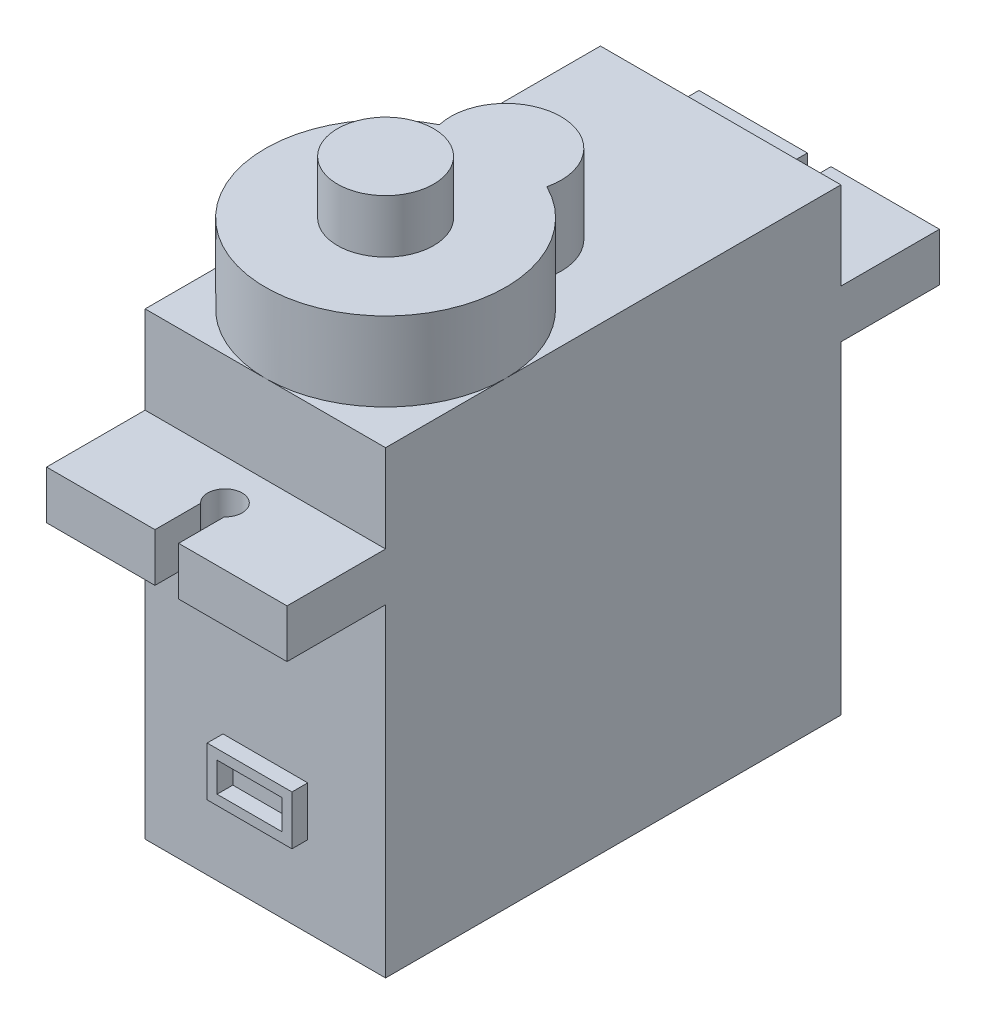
ISO-10303-21;
HEADER;
FILE_DESCRIPTION(('STEP AP214'),'2;1');
FILE_NAME('part.step','',(''),(''),'','','');
FILE_SCHEMA(('AUTOMOTIVE_DESIGN { 1 0 10303 214 1 1 1 1 }'));
ENDSEC;
DATA;
#1=APPLICATION_CONTEXT('core data for automotive mechanical design processes');
#2=APPLICATION_PROTOCOL_DEFINITION('international standard','automotive_design',2000,#1);
#3=PRODUCT_CONTEXT('',#1,'mechanical');
#4=PRODUCT('Part','Part','',(#3));
#5=PRODUCT_RELATED_PRODUCT_CATEGORY('part','',(#4));
#6=PRODUCT_DEFINITION_FORMATION('','',#4);
#7=PRODUCT_DEFINITION_CONTEXT('part definition',#1,'design');
#8=PRODUCT_DEFINITION('design','',#6,#7);
#9=PRODUCT_DEFINITION_SHAPE('','',#8);
#10=(LENGTH_UNIT() NAMED_UNIT(*) SI_UNIT(.MILLI.,.METRE.));
#11=(NAMED_UNIT(*) PLANE_ANGLE_UNIT() SI_UNIT($,.RADIAN.));
#12=(NAMED_UNIT(*) SI_UNIT($,.STERADIAN.) SOLID_ANGLE_UNIT());
#13=UNCERTAINTY_MEASURE_WITH_UNIT(LENGTH_MEASURE(1.E-05),#10,'distance_accuracy_value','');
#14=(GEOMETRIC_REPRESENTATION_CONTEXT(3) GLOBAL_UNCERTAINTY_ASSIGNED_CONTEXT((#13)) GLOBAL_UNIT_ASSIGNED_CONTEXT((#10,
#11,#12)) REPRESENTATION_CONTEXT('',''));
#15=CARTESIAN_POINT('',(0.,0.,0.));
#16=DIRECTION('',(0.,0.,1.));
#17=DIRECTION('',(1.,0.,0.));
#18=AXIS2_PLACEMENT_3D('',#15,#16,#17);
#19=CARTESIAN_POINT('',(12.2,18.85,-28.1));
#20=DIRECTION('',(0.,0.,1.));
#21=DIRECTION('',(1.,0.,0.));
#22=AXIS2_PLACEMENT_3D('',#19,#20,#21);
#23=PLANE('',#22);
#24=DIRECTION('',(-1.,0.,0.));
#25=VECTOR('',#24,1.);
#26=CARTESIAN_POINT('',(12.2,18.85,-28.1));
#27=LINE('',#26,#25);
#28=CARTESIAN_POINT('',(5.5,18.85,-28.1));
#29=VERTEX_POINT('',#28);
#30=CARTESIAN_POINT('',(0.,18.85,-28.1));
#31=VERTEX_POINT('',#30);
#32=EDGE_CURVE('E270',#29,#31,#27,.T.);
#33=ORIENTED_EDGE('',*,*,#32,.F.);
#34=DIRECTION('',(0.,1.,0.));
#35=VECTOR('',#34,1.);
#36=CARTESIAN_POINT('',(5.5,16.35,-28.1));
#37=LINE('',#36,#35);
#38=CARTESIAN_POINT('',(5.5,16.4,-28.1));
#39=VERTEX_POINT('',#38);
#40=EDGE_CURVE('E264',#39,#29,#37,.T.);
#41=ORIENTED_EDGE('',*,*,#40,.F.);
#42=DIRECTION('',(-1.,0.,0.));
#43=VECTOR('',#42,1.);
#44=CARTESIAN_POINT('',(12.2,16.4,-28.1));
#45=LINE('',#44,#43);
#46=CARTESIAN_POINT('',(0.,16.4,-28.1));
#47=VERTEX_POINT('',#46);
#48=EDGE_CURVE('E269',#39,#47,#45,.T.);
#49=ORIENTED_EDGE('',*,*,#48,.T.);
#50=DIRECTION('',(0.,1.,0.));
#51=VECTOR('',#50,1.);
#52=CARTESIAN_POINT('',(0.,18.85,-28.1));
#53=LINE('',#52,#51);
#54=EDGE_CURVE('E468',#47,#31,#53,.T.);
#55=ORIENTED_EDGE('',*,*,#54,.T.);
#56=EDGE_LOOP('',(#33,#41,#49,#55));
#57=FACE_BOUND('',#56,.T.);
#58=ADVANCED_FACE('F39',(#57),#23,.F.);
#59=CARTESIAN_POINT('',(12.2,18.85,5.));
#60=DIRECTION('',(0.,0.,-1.));
#61=DIRECTION('',(0.,1.,0.));
#62=AXIS2_PLACEMENT_3D('',#59,#60,#61);
#63=PLANE('',#62);
#64=DIRECTION('',(-1.,0.,0.));
#65=VECTOR('',#64,1.);
#66=CARTESIAN_POINT('',(12.2,18.85,5.));
#67=LINE('',#66,#65);
#68=CARTESIAN_POINT('',(12.2,18.85,5.));
#69=VERTEX_POINT('',#68);
#70=CARTESIAN_POINT('',(6.7,18.85,5.));
#71=VERTEX_POINT('',#70);
#72=EDGE_CURVE('E294',#69,#71,#67,.T.);
#73=ORIENTED_EDGE('',*,*,#72,.T.);
#74=DIRECTION('',(0.,1.,0.));
#75=VECTOR('',#74,1.);
#76=CARTESIAN_POINT('',(6.7,16.35,5.));
#77=LINE('',#76,#75);
#78=CARTESIAN_POINT('',(6.7,16.4,5.));
#79=VERTEX_POINT('',#78);
#80=EDGE_CURVE('E326',#79,#71,#77,.T.);
#81=ORIENTED_EDGE('',*,*,#80,.F.);
#82=DIRECTION('',(-1.,0.,0.));
#83=VECTOR('',#82,1.);
#84=CARTESIAN_POINT('',(12.2,16.4,4.99999999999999));
#85=LINE('',#84,#83);
#86=CARTESIAN_POINT('',(12.2,16.4,4.99999999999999));
#87=VERTEX_POINT('',#86);
#88=EDGE_CURVE('E290',#87,#79,#85,.T.);
#89=ORIENTED_EDGE('',*,*,#88,.F.);
#90=DIRECTION('',(0.,-1.,0.));
#91=VECTOR('',#90,1.);
#92=CARTESIAN_POINT('',(12.2,18.85,5.));
#93=LINE('',#92,#91);
#94=EDGE_CURVE('E428',#69,#87,#93,.T.);
#95=ORIENTED_EDGE('',*,*,#94,.F.);
#96=EDGE_LOOP('',(#73,#81,#89,#95));
#97=FACE_BOUND('',#96,.T.);
#98=ADVANCED_FACE('F561',(#97),#63,.F.);
#99=CARTESIAN_POINT('',(12.2,16.4,0.));
#100=DIRECTION('',(0.,0.,-1.));
#101=DIRECTION('',(0.,1.,0.));
#102=AXIS2_PLACEMENT_3D('',#99,#100,#101);
#103=PLANE('',#102);
#104=DIRECTION('',(0.,-1.,0.));
#105=VECTOR('',#104,1.);
#106=CARTESIAN_POINT('',(0.,16.4,0.));
#107=LINE('',#106,#105);
#108=CARTESIAN_POINT('',(0.,16.4,0.));
#109=VERTEX_POINT('',#108);
#110=CARTESIAN_POINT('',(0.,0.,0.));
#111=VERTEX_POINT('',#110);
#112=EDGE_CURVE('E459',#109,#111,#107,.T.);
#113=ORIENTED_EDGE('',*,*,#112,.T.);
#114=DIRECTION('',(-1.,0.,0.));
#115=VECTOR('',#114,1.);
#116=CARTESIAN_POINT('',(12.2,0.,0.));
#117=LINE('',#116,#115);
#118=CARTESIAN_POINT('',(12.2,0.,0.));
#119=VERTEX_POINT('',#118);
#120=EDGE_CURVE('E283',#119,#111,#117,.T.);
#121=ORIENTED_EDGE('',*,*,#120,.F.);
#122=DIRECTION('',(0.,-1.,0.));
#123=VECTOR('',#122,1.);
#124=CARTESIAN_POINT('',(12.2,16.4,0.));
#125=LINE('',#124,#123);
#126=CARTESIAN_POINT('',(12.2,16.4,0.));
#127=VERTEX_POINT('',#126);
#128=EDGE_CURVE('E432',#127,#119,#125,.T.);
#129=ORIENTED_EDGE('',*,*,#128,.F.);
#130=DIRECTION('',(-1.,0.,0.));
#131=VECTOR('',#130,1.);
#132=CARTESIAN_POINT('',(12.2,16.4,0.));
#133=LINE('',#132,#131);
#134=EDGE_CURVE('E286',#127,#109,#133,.T.);
#135=ORIENTED_EDGE('',*,*,#134,.T.);
#136=EDGE_LOOP('',(#113,#121,#129,#135));
#137=FACE_BOUND('',#136,.T.);
#138=DIRECTION('',(0.,-1.,0.));
#139=VECTOR('',#138,1.);
#140=CARTESIAN_POINT('',(3.95,4.1,0.));
#141=LINE('',#140,#139);
#142=CARTESIAN_POINT('',(3.95,6.6,0.));
#143=VERTEX_POINT('',#142);
#144=CARTESIAN_POINT('',(3.95,4.1,0.));
#145=VERTEX_POINT('',#144);
#146=EDGE_CURVE('E363',#143,#145,#141,.T.);
#147=ORIENTED_EDGE('',*,*,#146,.F.);
#148=DIRECTION('',(-1.,0.,0.));
#149=VECTOR('',#148,1.);
#150=CARTESIAN_POINT('',(3.95,6.6,0.));
#151=LINE('',#150,#149);
#152=CARTESIAN_POINT('',(8.25,6.6,0.));
#153=VERTEX_POINT('',#152);
#154=EDGE_CURVE('E368',#153,#143,#151,.T.);
#155=ORIENTED_EDGE('',*,*,#154,.F.);
#156=DIRECTION('',(0.,1.,0.));
#157=VECTOR('',#156,1.);
#158=CARTESIAN_POINT('',(8.25,4.1,0.));
#159=LINE('',#158,#157);
#160=CARTESIAN_POINT('',(8.25,4.1,0.));
#161=VERTEX_POINT('',#160);
#162=EDGE_CURVE('E380',#161,#153,#159,.T.);
#163=ORIENTED_EDGE('',*,*,#162,.F.);
#164=DIRECTION('',(1.,0.,0.));
#165=VECTOR('',#164,1.);
#166=CARTESIAN_POINT('',(3.95,4.1,0.));
#167=LINE('',#166,#165);
#168=EDGE_CURVE('E377',#145,#161,#167,.T.);
#169=ORIENTED_EDGE('',*,*,#168,.F.);
#170=EDGE_LOOP('',(#147,#155,#163,#169));
#171=FACE_BOUND('',#170,.T.);
#172=ADVANCED_FACE('F553',(#137,#171),#103,.F.);
#173=CARTESIAN_POINT('',(6.1,27.3,-9.14999999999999));
#174=DIRECTION('',(0.,1.,0.));
#175=DIRECTION('',(0.,0.,1.));
#176=AXIS2_PLACEMENT_3D('',#173,#174,#175);
#177=PLANE('',#176);
#178=CARTESIAN_POINT('',(6.1,27.3,-12.2));
#179=DIRECTION('',(0.,1.,0.));
#180=DIRECTION('',(0.,0.,1.));
#181=AXIS2_PLACEMENT_3D('',#178,#179,#180);
#182=CIRCLE('',#181,2.8);
#183=CARTESIAN_POINT('',(8.82525883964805,27.3,-11.5573770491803));
#184=VERTEX_POINT('',#183);
#185=CARTESIAN_POINT('',(3.37474116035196,27.3,-11.5573770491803));
#186=VERTEX_POINT('',#185);
#187=EDGE_CURVE('E403',#184,#186,#182,.T.);
#188=ORIENTED_EDGE('',*,*,#187,.T.);
#189=CARTESIAN_POINT('',(6.1,27.3,-6.09999999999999));
#190=DIRECTION('',(0.,1.,0.));
#191=DIRECTION('',(0.,0.,1.));
#192=AXIS2_PLACEMENT_3D('',#189,#190,#191);
#193=CIRCLE('',#192,6.09999999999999);
#194=EDGE_CURVE('E406',#186,#184,#193,.T.);
#195=ORIENTED_EDGE('',*,*,#194,.T.);
#196=EDGE_LOOP('',(#188,#195));
#197=FACE_BOUND('',#196,.T.);
#198=CARTESIAN_POINT('',(6.1,27.3,-6.09999999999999));
#199=DIRECTION('',(0.,1.,0.));
#200=DIRECTION('',(0.,0.,1.));
#201=AXIS2_PLACEMENT_3D('',#198,#199,#200);
#202=CIRCLE('',#201,2.44);
#203=CARTESIAN_POINT('',(6.1,27.3,-8.53999999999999));
#204=VERTEX_POINT('',#203);
#205=EDGE_CURVE('E396',#204,#204,#202,.T.);
#206=ORIENTED_EDGE('',*,*,#205,.F.);
#207=EDGE_LOOP('',(#206));
#208=FACE_BOUND('',#207,.T.);
#209=ADVANCED_FACE('F568',(#197,#208),#177,.T.);
#210=CARTESIAN_POINT('',(12.2,23.3,0.));
#211=DIRECTION('',(0.,-1.,0.));
#212=DIRECTION('',(0.,0.,-1.));
#213=AXIS2_PLACEMENT_3D('',#210,#211,#212);
#214=PLANE('',#213);
#215=CARTESIAN_POINT('',(6.1,23.3,-12.2));
#216=DIRECTION('',(0.,1.,0.));
#217=DIRECTION('',(0.,0.,1.));
#218=AXIS2_PLACEMENT_3D('',#215,#216,#217);
#219=CIRCLE('',#218,2.8);
#220=CARTESIAN_POINT('',(8.82525883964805,23.3,-11.5573770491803));
#221=VERTEX_POINT('',#220);
#222=CARTESIAN_POINT('',(3.37474116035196,23.3,-11.5573770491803));
#223=VERTEX_POINT('',#222);
#224=EDGE_CURVE('E400',#221,#223,#219,.T.);
#225=ORIENTED_EDGE('',*,*,#224,.F.);
#226=CARTESIAN_POINT('',(6.1,23.3,-6.09999999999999));
#227=DIRECTION('',(0.,1.,0.));
#228=DIRECTION('',(0.,0.,1.));
#229=AXIS2_PLACEMENT_3D('',#226,#227,#228);
#230=CIRCLE('',#229,6.09999999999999);
#231=CARTESIAN_POINT('',(12.2,23.3,-6.09999999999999));
#232=VERTEX_POINT('',#231);
#233=EDGE_CURVE('E304',#232,#221,#230,.T.);
#234=ORIENTED_EDGE('',*,*,#233,.F.);
#235=DIRECTION('',(0.,0.,1.));
#236=VECTOR('',#235,1.);
#237=CARTESIAN_POINT('',(12.2,23.3,0.));
#238=LINE('',#237,#236);
#239=CARTESIAN_POINT('',(12.2,23.3,-23.1));
#240=VERTEX_POINT('',#239);
#241=EDGE_CURVE('E420',#240,#232,#238,.T.);
#242=ORIENTED_EDGE('',*,*,#241,.F.);
#243=DIRECTION('',(-1.,0.,0.));
#244=VECTOR('',#243,1.);
#245=CARTESIAN_POINT('',(12.2,23.3,-23.1));
#246=LINE('',#245,#244);
#247=CARTESIAN_POINT('',(0.,23.3,-23.1));
#248=VERTEX_POINT('',#247);
#249=EDGE_CURVE('E445',#240,#248,#246,.T.);
#250=ORIENTED_EDGE('',*,*,#249,.T.);
#251=DIRECTION('',(0.,0.,1.));
#252=VECTOR('',#251,1.);
#253=CARTESIAN_POINT('',(0.,23.3,0.));
#254=LINE('',#253,#252);
#255=CARTESIAN_POINT('',(0.,23.3,-6.09999999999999));
#256=VERTEX_POINT('',#255);
#257=EDGE_CURVE('E446',#248,#256,#254,.T.);
#258=ORIENTED_EDGE('',*,*,#257,.T.);
#259=EDGE_CURVE('E407',#223,#256,#230,.T.);
#260=ORIENTED_EDGE('',*,*,#259,.F.);
#261=EDGE_LOOP('',(#225,#234,#242,#250,#258,#260));
#262=FACE_BOUND('',#261,.T.);
#263=ADVANCED_FACE('F41',(#262),#214,.F.);
#264=CARTESIAN_POINT('',(6.1,23.3,0.));
#265=VERTEX_POINT('',#264);
#266=EDGE_CURVE('E306',#256,#265,#230,.T.);
#267=ORIENTED_EDGE('',*,*,#266,.F.);
#268=CARTESIAN_POINT('',(0.,23.3,0.));
#269=VERTEX_POINT('',#268);
#270=EDGE_CURVE('E419',#256,#269,#254,.T.);
#271=ORIENTED_EDGE('',*,*,#270,.T.);
#272=DIRECTION('',(-1.,0.,0.));
#273=VECTOR('',#272,1.);
#274=CARTESIAN_POINT('',(12.2,23.3,0.));
#275=LINE('',#274,#273);
#276=EDGE_CURVE('E300',#265,#269,#275,.T.);
#277=ORIENTED_EDGE('',*,*,#276,.F.);
#278=EDGE_LOOP('',(#267,#271,#277));
#279=FACE_BOUND('',#278,.T.);
#280=ADVANCED_FACE('F508',(#279),#214,.F.);
#281=EDGE_CURVE('E502',#265,#232,#230,.T.);
#282=ORIENTED_EDGE('',*,*,#281,.F.);
#283=CARTESIAN_POINT('',(12.2,23.3,0.));
#284=VERTEX_POINT('',#283);
#285=EDGE_CURVE('E301',#284,#265,#275,.T.);
#286=ORIENTED_EDGE('',*,*,#285,.F.);
#287=EDGE_CURVE('E424',#232,#284,#238,.T.);
#288=ORIENTED_EDGE('',*,*,#287,.F.);
#289=EDGE_LOOP('',(#282,#286,#288));
#290=FACE_BOUND('',#289,.T.);
#291=ADVANCED_FACE('F506',(#290),#214,.F.);
#292=CARTESIAN_POINT('',(12.2,23.3,0.));
#293=DIRECTION('',(0.,0.,-1.));
#294=DIRECTION('',(0.,1.,0.));
#295=AXIS2_PLACEMENT_3D('',#292,#293,#294);
#296=PLANE('',#295);
#297=DIRECTION('',(0.,-1.,0.));
#298=VECTOR('',#297,1.);
#299=CARTESIAN_POINT('',(0.,23.3,0.));
#300=LINE('',#299,#298);
#301=CARTESIAN_POINT('',(0.,18.85,0.));
#302=VERTEX_POINT('',#301);
#303=EDGE_CURVE('E449',#269,#302,#300,.T.);
#304=ORIENTED_EDGE('',*,*,#303,.T.);
#305=DIRECTION('',(-1.,0.,0.));
#306=VECTOR('',#305,1.);
#307=CARTESIAN_POINT('',(12.2,18.85,0.));
#308=LINE('',#307,#306);
#309=CARTESIAN_POINT('',(12.2,18.85,0.));
#310=VERTEX_POINT('',#309);
#311=EDGE_CURVE('E297',#310,#302,#308,.T.);
#312=ORIENTED_EDGE('',*,*,#311,.F.);
#313=DIRECTION('',(0.,-1.,0.));
#314=VECTOR('',#313,1.);
#315=CARTESIAN_POINT('',(12.2,23.3,0.));
#316=LINE('',#315,#314);
#317=EDGE_CURVE('E423',#284,#310,#316,.T.);
#318=ORIENTED_EDGE('',*,*,#317,.F.);
#319=ORIENTED_EDGE('',*,*,#285,.T.);
#320=ORIENTED_EDGE('',*,*,#276,.T.);
#321=EDGE_LOOP('',(#304,#312,#318,#319,#320));
#322=FACE_BOUND('',#321,.T.);
#323=ADVANCED_FACE('F511',(#322),#296,.F.);
#324=CARTESIAN_POINT('',(12.2,18.85,0.));
#325=DIRECTION('',(0.,-1.,0.));
#326=DIRECTION('',(0.,0.,-1.));
#327=AXIS2_PLACEMENT_3D('',#324,#325,#326);
#328=PLANE('',#327);
#329=CARTESIAN_POINT('',(6.1,18.85,2.05));
#330=DIRECTION('',(0.,1.,0.));
#331=DIRECTION('',(0.,0.,1.));
#332=AXIS2_PLACEMENT_3D('',#329,#330,#331);
#333=CIRCLE('',#332,0.874751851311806);
#334=CARTESIAN_POINT('',(6.7,18.85,2.68654599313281));
#335=VERTEX_POINT('',#334);
#336=CARTESIAN_POINT('',(5.5,18.85,2.68654599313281));
#337=VERTEX_POINT('',#336);
#338=EDGE_CURVE('E535',#335,#337,#333,.T.);
#339=ORIENTED_EDGE('',*,*,#338,.F.);
#340=DIRECTION('',(0.,0.,-1.));
#341=VECTOR('',#340,1.);
#342=CARTESIAN_POINT('',(6.7,18.85,5.));
#343=LINE('',#342,#341);
#344=EDGE_CURVE('E323',#71,#335,#343,.T.);
#345=ORIENTED_EDGE('',*,*,#344,.F.);
#346=ORIENTED_EDGE('',*,*,#72,.F.);
#347=DIRECTION('',(0.,0.,1.));
#348=VECTOR('',#347,1.);
#349=CARTESIAN_POINT('',(12.2,18.85,0.));
#350=LINE('',#349,#348);
#351=EDGE_CURVE('E426',#310,#69,#350,.T.);
#352=ORIENTED_EDGE('',*,*,#351,.F.);
#353=ORIENTED_EDGE('',*,*,#311,.T.);
#354=DIRECTION('',(0.,0.,1.));
#355=VECTOR('',#354,1.);
#356=CARTESIAN_POINT('',(0.,18.85,0.));
#357=LINE('',#356,#355);
#358=CARTESIAN_POINT('',(0.,18.85,5.));
#359=VERTEX_POINT('',#358);
#360=EDGE_CURVE('E451',#302,#359,#357,.T.);
#361=ORIENTED_EDGE('',*,*,#360,.T.);
#362=CARTESIAN_POINT('',(5.5,18.85,5.));
#363=VERTEX_POINT('',#362);
#364=EDGE_CURVE('E293',#363,#359,#67,.T.);
#365=ORIENTED_EDGE('',*,*,#364,.F.);
#366=DIRECTION('',(0.,0.,1.));
#367=VECTOR('',#366,1.);
#368=CARTESIAN_POINT('',(5.5,18.85,2.68654599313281));
#369=LINE('',#368,#367);
#370=EDGE_CURVE('E536',#337,#363,#369,.T.);
#371=ORIENTED_EDGE('',*,*,#370,.F.);
#372=EDGE_LOOP('',(#339,#345,#346,#352,#353,#361,#365,#371));
#373=FACE_BOUND('',#372,.T.);
#374=ADVANCED_FACE('F543',(#373),#328,.F.);
#375=CARTESIAN_POINT('',(5.5,16.4,4.99999999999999));
#376=VERTEX_POINT('',#375);
#377=CARTESIAN_POINT('',(0.,16.4,4.99999999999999));
#378=VERTEX_POINT('',#377);
#379=EDGE_CURVE('E289',#376,#378,#85,.T.);
#380=ORIENTED_EDGE('',*,*,#379,.F.);
#381=DIRECTION('',(0.,1.,0.));
#382=VECTOR('',#381,1.);
#383=CARTESIAN_POINT('',(5.5,16.35,5.));
#384=LINE('',#383,#382);
#385=EDGE_CURVE('E62',#376,#363,#384,.T.);
#386=ORIENTED_EDGE('',*,*,#385,.T.);
#387=ORIENTED_EDGE('',*,*,#364,.T.);
#388=DIRECTION('',(0.,-1.,0.));
#389=VECTOR('',#388,1.);
#390=CARTESIAN_POINT('',(0.,18.85,5.));
#391=LINE('',#390,#389);
#392=EDGE_CURVE('E454',#359,#378,#391,.T.);
#393=ORIENTED_EDGE('',*,*,#392,.T.);
#394=EDGE_LOOP('',(#380,#386,#387,#393));
#395=FACE_BOUND('',#394,.T.);
#396=ADVANCED_FACE('F542',(#395),#63,.F.);
#397=CARTESIAN_POINT('',(12.2,16.4,4.99999999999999));
#398=DIRECTION('',(0.,1.,0.));
#399=DIRECTION('',(0.,0.,1.));
#400=AXIS2_PLACEMENT_3D('',#397,#398,#399);
#401=PLANE('',#400);
#402=ORIENTED_EDGE('',*,*,#88,.T.);
#403=DIRECTION('',(0.,0.,-1.));
#404=VECTOR('',#403,1.);
#405=CARTESIAN_POINT('',(6.7,16.4,4.99999999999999));
#406=LINE('',#405,#404);
#407=CARTESIAN_POINT('',(6.7,16.4,2.68654599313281));
#408=VERTEX_POINT('',#407);
#409=EDGE_CURVE('E11',#79,#408,#406,.T.);
#410=ORIENTED_EDGE('',*,*,#409,.T.);
#411=CARTESIAN_POINT('',(6.1,16.4,2.05));
#412=DIRECTION('',(0.,1.,0.));
#413=DIRECTION('',(0.,0.,1.));
#414=AXIS2_PLACEMENT_3D('',#411,#412,#413);
#415=CIRCLE('',#414,0.874751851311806);
#416=CARTESIAN_POINT('',(5.5,16.4,2.68654599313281));
#417=VERTEX_POINT('',#416);
#418=EDGE_CURVE('E47',#408,#417,#415,.T.);
#419=ORIENTED_EDGE('',*,*,#418,.T.);
#420=DIRECTION('',(0.,0.,1.));
#421=VECTOR('',#420,1.);
#422=CARTESIAN_POINT('',(5.5,16.4,4.99999999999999));
#423=LINE('',#422,#421);
#424=EDGE_CURVE('E305',#417,#376,#423,.T.);
#425=ORIENTED_EDGE('',*,*,#424,.T.);
#426=ORIENTED_EDGE('',*,*,#379,.T.);
#427=DIRECTION('',(0.,0.,-1.));
#428=VECTOR('',#427,1.);
#429=CARTESIAN_POINT('',(0.,16.4,4.99999999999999));
#430=LINE('',#429,#428);
#431=EDGE_CURVE('E457',#378,#109,#430,.T.);
#432=ORIENTED_EDGE('',*,*,#431,.T.);
#433=ORIENTED_EDGE('',*,*,#134,.F.);
#434=DIRECTION('',(0.,0.,-1.));
#435=VECTOR('',#434,1.);
#436=CARTESIAN_POINT('',(12.2,16.4,4.99999999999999));
#437=LINE('',#436,#435);
#438=EDGE_CURVE('E430',#87,#127,#437,.T.);
#439=ORIENTED_EDGE('',*,*,#438,.F.);
#440=EDGE_LOOP('',(#402,#410,#419,#425,#426,#432,#433,#439));
#441=FACE_BOUND('',#440,.T.);
#442=ADVANCED_FACE('F309',(#441),#401,.F.);
#443=CARTESIAN_POINT('',(12.2,0.,0.));
#444=DIRECTION('',(0.,1.,0.));
#445=DIRECTION('',(0.,0.,1.));
#446=AXIS2_PLACEMENT_3D('',#443,#444,#445);
#447=PLANE('',#446);
#448=DIRECTION('',(0.,0.,-1.));
#449=VECTOR('',#448,1.);
#450=CARTESIAN_POINT('',(0.,0.,0.));
#451=LINE('',#450,#449);
#452=CARTESIAN_POINT('',(0.,0.,-23.1));
#453=VERTEX_POINT('',#452);
#454=EDGE_CURVE('E461',#111,#453,#451,.T.);
#455=ORIENTED_EDGE('',*,*,#454,.T.);
#456=DIRECTION('',(-1.,0.,0.));
#457=VECTOR('',#456,1.);
#458=CARTESIAN_POINT('',(12.2,0.,-23.1));
#459=LINE('',#458,#457);
#460=CARTESIAN_POINT('',(12.2,0.,-23.1));
#461=VERTEX_POINT('',#460);
#462=EDGE_CURVE('E280',#461,#453,#459,.T.);
#463=ORIENTED_EDGE('',*,*,#462,.F.);
#464=DIRECTION('',(0.,0.,-1.));
#465=VECTOR('',#464,1.);
#466=CARTESIAN_POINT('',(12.2,0.,0.));
#467=LINE('',#466,#465);
#468=EDGE_CURVE('E434',#119,#461,#467,.T.);
#469=ORIENTED_EDGE('',*,*,#468,.F.);
#470=ORIENTED_EDGE('',*,*,#120,.T.);
#471=EDGE_LOOP('',(#455,#463,#469,#470));
#472=FACE_BOUND('',#471,.T.);
#473=ADVANCED_FACE('F580',(#472),#447,.F.);
#474=CARTESIAN_POINT('',(12.2,16.4,-23.1));
#475=DIRECTION('',(0.,0.,1.));
#476=DIRECTION('',(1.,0.,0.));
#477=AXIS2_PLACEMENT_3D('',#474,#475,#476);
#478=PLANE('',#477);
#479=DIRECTION('',(0.,1.,0.));
#480=VECTOR('',#479,1.);
#481=CARTESIAN_POINT('',(0.,16.4,-23.1));
#482=LINE('',#481,#480);
#483=CARTESIAN_POINT('',(0.,16.4,-23.1));
#484=VERTEX_POINT('',#483);
#485=EDGE_CURVE('E463',#453,#484,#482,.T.);
#486=ORIENTED_EDGE('',*,*,#485,.T.);
#487=DIRECTION('',(-1.,0.,0.));
#488=VECTOR('',#487,1.);
#489=CARTESIAN_POINT('',(12.2,16.4,-23.1));
#490=LINE('',#489,#488);
#491=CARTESIAN_POINT('',(12.2,16.4,-23.1));
#492=VERTEX_POINT('',#491);
#493=EDGE_CURVE('E277',#492,#484,#490,.T.);
#494=ORIENTED_EDGE('',*,*,#493,.F.);
#495=DIRECTION('',(0.,1.,0.));
#496=VECTOR('',#495,1.);
#497=CARTESIAN_POINT('',(12.2,16.4,-23.1));
#498=LINE('',#497,#496);
#499=EDGE_CURVE('E436',#461,#492,#498,.T.);
#500=ORIENTED_EDGE('',*,*,#499,.F.);
#501=ORIENTED_EDGE('',*,*,#462,.T.);
#502=EDGE_LOOP('',(#486,#494,#500,#501));
#503=FACE_BOUND('',#502,.T.);
#504=ADVANCED_FACE('F618',(#503),#478,.F.);
#505=CARTESIAN_POINT('',(12.2,16.4,-28.1));
#506=DIRECTION('',(0.,1.,0.));
#507=DIRECTION('',(0.,0.,1.));
#508=AXIS2_PLACEMENT_3D('',#505,#506,#507);
#509=PLANE('',#508);
#510=ORIENTED_EDGE('',*,*,#48,.F.);
#511=DIRECTION('',(0.,0.,1.));
#512=VECTOR('',#511,1.);
#513=CARTESIAN_POINT('',(5.5,16.4,-28.1));
#514=LINE('',#513,#512);
#515=CARTESIAN_POINT('',(5.5,16.4,-25.7865459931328));
#516=VERTEX_POINT('',#515);
#517=EDGE_CURVE('E527',#39,#516,#514,.T.);
#518=ORIENTED_EDGE('',*,*,#517,.T.);
#519=CARTESIAN_POINT('',(6.1,16.4,-25.05));
#520=DIRECTION('',(0.,1.,0.));
#521=DIRECTION('',(0.,0.,1.));
#522=AXIS2_PLACEMENT_3D('',#519,#520,#521);
#523=CIRCLE('',#522,0.949999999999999);
#524=CARTESIAN_POINT('',(6.7,16.4,-25.7865459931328));
#525=VERTEX_POINT('',#524);
#526=EDGE_CURVE('E526',#516,#525,#523,.T.);
#527=ORIENTED_EDGE('',*,*,#526,.T.);
#528=DIRECTION('',(0.,0.,-1.));
#529=VECTOR('',#528,1.);
#530=CARTESIAN_POINT('',(6.7,16.4,-28.1));
#531=LINE('',#530,#529);
#532=CARTESIAN_POINT('',(6.7,16.4,-28.1));
#533=VERTEX_POINT('',#532);
#534=EDGE_CURVE('E524',#525,#533,#531,.T.);
#535=ORIENTED_EDGE('',*,*,#534,.T.);
#536=CARTESIAN_POINT('',(12.2,16.4,-28.1));
#537=VERTEX_POINT('',#536);
#538=EDGE_CURVE('E263',#537,#533,#45,.T.);
#539=ORIENTED_EDGE('',*,*,#538,.F.);
#540=DIRECTION('',(0.,0.,-1.));
#541=VECTOR('',#540,1.);
#542=CARTESIAN_POINT('',(12.2,16.4,-28.1));
#543=LINE('',#542,#541);
#544=EDGE_CURVE('E438',#492,#537,#543,.T.);
#545=ORIENTED_EDGE('',*,*,#544,.F.);
#546=ORIENTED_EDGE('',*,*,#493,.T.);
#547=DIRECTION('',(0.,0.,-1.));
#548=VECTOR('',#547,1.);
#549=CARTESIAN_POINT('',(0.,16.4,-28.1));
#550=LINE('',#549,#548);
#551=EDGE_CURVE('E465',#484,#47,#550,.T.);
#552=ORIENTED_EDGE('',*,*,#551,.T.);
#553=EDGE_LOOP('',(#510,#518,#527,#535,#539,#545,#546,#552));
#554=FACE_BOUND('',#553,.T.);
#555=ADVANCED_FACE('F522',(#554),#509,.F.);
#556=ORIENTED_EDGE('',*,*,#538,.T.);
#557=DIRECTION('',(0.,1.,0.));
#558=VECTOR('',#557,1.);
#559=CARTESIAN_POINT('',(6.7,16.35,-28.1));
#560=LINE('',#559,#558);
#561=CARTESIAN_POINT('',(6.7,18.85,-28.1));
#562=VERTEX_POINT('',#561);
#563=EDGE_CURVE('E248',#533,#562,#560,.T.);
#564=ORIENTED_EDGE('',*,*,#563,.T.);
#565=CARTESIAN_POINT('',(12.2,18.85,-28.1));
#566=VERTEX_POINT('',#565);
#567=EDGE_CURVE('E260',#566,#562,#27,.T.);
#568=ORIENTED_EDGE('',*,*,#567,.F.);
#569=DIRECTION('',(0.,1.,0.));
#570=VECTOR('',#569,1.);
#571=CARTESIAN_POINT('',(12.2,18.85,-28.1));
#572=LINE('',#571,#570);
#573=EDGE_CURVE('E440',#537,#566,#572,.T.);
#574=ORIENTED_EDGE('',*,*,#573,.F.);
#575=EDGE_LOOP('',(#556,#564,#568,#574));
#576=FACE_BOUND('',#575,.T.);
#577=ADVANCED_FACE('F258',(#576),#23,.F.);
#578=CARTESIAN_POINT('',(12.2,18.85,-23.1));
#579=DIRECTION('',(0.,-1.,0.));
#580=DIRECTION('',(0.,0.,-1.));
#581=AXIS2_PLACEMENT_3D('',#578,#579,#580);
#582=PLANE('',#581);
#583=CARTESIAN_POINT('',(6.1,18.85,-25.05));
#584=DIRECTION('',(0.,1.,0.));
#585=DIRECTION('',(0.,0.,-1.));
#586=AXIS2_PLACEMENT_3D('',#583,#584,#585);
#587=CIRCLE('',#586,0.949999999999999);
#588=CARTESIAN_POINT('',(5.5,18.85,-25.7865459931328));
#589=VERTEX_POINT('',#588);
#590=CARTESIAN_POINT('',(6.7,18.85,-25.7865459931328));
#591=VERTEX_POINT('',#590);
#592=EDGE_CURVE('E54',#589,#591,#587,.T.);
#593=ORIENTED_EDGE('',*,*,#592,.F.);
#594=DIRECTION('',(0.,0.,1.));
#595=VECTOR('',#594,1.);
#596=CARTESIAN_POINT('',(5.5,18.85,-25.7865459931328));
#597=LINE('',#596,#595);
#598=EDGE_CURVE('E253',#29,#589,#597,.T.);
#599=ORIENTED_EDGE('',*,*,#598,.F.);
#600=ORIENTED_EDGE('',*,*,#32,.T.);
#601=DIRECTION('',(0.,0.,1.));
#602=VECTOR('',#601,1.);
#603=CARTESIAN_POINT('',(0.,18.85,-23.1));
#604=LINE('',#603,#602);
#605=CARTESIAN_POINT('',(0.,18.85,-23.1));
#606=VERTEX_POINT('',#605);
#607=EDGE_CURVE('E471',#31,#606,#604,.T.);
#608=ORIENTED_EDGE('',*,*,#607,.T.);
#609=DIRECTION('',(-1.,0.,0.));
#610=VECTOR('',#609,1.);
#611=CARTESIAN_POINT('',(12.2,18.85,-23.1));
#612=LINE('',#611,#610);
#613=CARTESIAN_POINT('',(12.2,18.85,-23.1));
#614=VERTEX_POINT('',#613);
#615=EDGE_CURVE('E273',#614,#606,#612,.T.);
#616=ORIENTED_EDGE('',*,*,#615,.F.);
#617=DIRECTION('',(0.,0.,1.));
#618=VECTOR('',#617,1.);
#619=CARTESIAN_POINT('',(12.2,18.85,-23.1));
#620=LINE('',#619,#618);
#621=EDGE_CURVE('E268',#566,#614,#620,.T.);
#622=ORIENTED_EDGE('',*,*,#621,.F.);
#623=ORIENTED_EDGE('',*,*,#567,.T.);
#624=DIRECTION('',(0.,0.,-1.));
#625=VECTOR('',#624,1.);
#626=CARTESIAN_POINT('',(6.7,18.85,-28.1));
#627=LINE('',#626,#625);
#628=EDGE_CURVE('E245',#591,#562,#627,.T.);
#629=ORIENTED_EDGE('',*,*,#628,.F.);
#630=EDGE_LOOP('',(#593,#599,#600,#608,#616,#622,#623,#629));
#631=FACE_BOUND('',#630,.T.);
#632=ADVANCED_FACE('F266',(#631),#582,.F.);
#633=CARTESIAN_POINT('',(12.2,23.3,-23.1));
#634=DIRECTION('',(0.,0.,1.));
#635=DIRECTION('',(1.,0.,0.));
#636=AXIS2_PLACEMENT_3D('',#633,#634,#635);
#637=PLANE('',#636);
#638=DIRECTION('',(0.,1.,0.));
#639=VECTOR('',#638,1.);
#640=CARTESIAN_POINT('',(0.,23.3,-23.1));
#641=LINE('',#640,#639);
#642=EDGE_CURVE('E473',#606,#248,#641,.T.);
#643=ORIENTED_EDGE('',*,*,#642,.T.);
#644=ORIENTED_EDGE('',*,*,#249,.F.);
#645=DIRECTION('',(0.,1.,0.));
#646=VECTOR('',#645,1.);
#647=CARTESIAN_POINT('',(12.2,23.3,-23.1));
#648=LINE('',#647,#646);
#649=EDGE_CURVE('E443',#614,#240,#648,.T.);
#650=ORIENTED_EDGE('',*,*,#649,.F.);
#651=ORIENTED_EDGE('',*,*,#615,.T.);
#652=EDGE_LOOP('',(#643,#644,#650,#651));
#653=FACE_BOUND('',#652,.T.);
#654=ADVANCED_FACE('F483',(#653),#637,.F.);
#655=CARTESIAN_POINT('',(12.2,0.,0.));
#656=DIRECTION('',(-1.,0.,0.));
#657=DIRECTION('',(0.,0.,1.));
#658=AXIS2_PLACEMENT_3D('',#655,#656,#657);
#659=PLANE('',#658);
#660=ORIENTED_EDGE('',*,*,#241,.T.);
#661=ORIENTED_EDGE('',*,*,#287,.T.);
#662=ORIENTED_EDGE('',*,*,#317,.T.);
#663=ORIENTED_EDGE('',*,*,#351,.T.);
#664=ORIENTED_EDGE('',*,*,#94,.T.);
#665=ORIENTED_EDGE('',*,*,#438,.T.);
#666=ORIENTED_EDGE('',*,*,#128,.T.);
#667=ORIENTED_EDGE('',*,*,#468,.T.);
#668=ORIENTED_EDGE('',*,*,#499,.T.);
#669=ORIENTED_EDGE('',*,*,#544,.T.);
#670=ORIENTED_EDGE('',*,*,#573,.T.);
#671=ORIENTED_EDGE('',*,*,#621,.T.);
#672=ORIENTED_EDGE('',*,*,#649,.T.);
#673=EDGE_LOOP('',(#660,#661,#662,#663,#664,#665,#666,#667,#668,#669,#670,#671,#672));
#674=FACE_BOUND('',#673,.T.);
#675=ADVANCED_FACE('F515',(#674),#659,.F.);
#676=CARTESIAN_POINT('',(0.,0.,0.));
#677=DIRECTION('',(-1.,0.,0.));
#678=DIRECTION('',(0.,0.,1.));
#679=AXIS2_PLACEMENT_3D('',#676,#677,#678);
#680=PLANE('',#679);
#681=ORIENTED_EDGE('',*,*,#257,.F.);
#682=ORIENTED_EDGE('',*,*,#642,.F.);
#683=ORIENTED_EDGE('',*,*,#607,.F.);
#684=ORIENTED_EDGE('',*,*,#54,.F.);
#685=ORIENTED_EDGE('',*,*,#551,.F.);
#686=ORIENTED_EDGE('',*,*,#485,.F.);
#687=ORIENTED_EDGE('',*,*,#454,.F.);
#688=ORIENTED_EDGE('',*,*,#112,.F.);
#689=ORIENTED_EDGE('',*,*,#431,.F.);
#690=ORIENTED_EDGE('',*,*,#392,.F.);
#691=ORIENTED_EDGE('',*,*,#360,.F.);
#692=ORIENTED_EDGE('',*,*,#303,.F.);
#693=ORIENTED_EDGE('',*,*,#270,.F.);
#694=EDGE_LOOP('',(#681,#682,#683,#684,#685,#686,#687,#688,#689,#690,#691,#692,#693));
#695=FACE_BOUND('',#694,.T.);
#696=ADVANCED_FACE('F486',(#695),#680,.T.);
#697=CARTESIAN_POINT('',(6.1,27.3,-12.2));
#698=DIRECTION('',(0.,-1.,0.));
#699=DIRECTION('',(0.,0.,-1.));
#700=AXIS2_PLACEMENT_3D('',#697,#698,#699);
#701=CYLINDRICAL_SURFACE('',#700,2.8);
#702=ORIENTED_EDGE('',*,*,#224,.T.);
#703=DIRECTION('',(0.,-1.,0.));
#704=VECTOR('',#703,1.);
#705=CARTESIAN_POINT('',(3.37474116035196,27.3,-11.5573770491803));
#706=LINE('',#705,#704);
#707=EDGE_CURVE('E416',#186,#223,#706,.T.);
#708=ORIENTED_EDGE('',*,*,#707,.F.);
#709=ORIENTED_EDGE('',*,*,#187,.F.);
#710=DIRECTION('',(0.,-1.,0.));
#711=VECTOR('',#710,1.);
#712=CARTESIAN_POINT('',(8.82525883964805,27.3,-11.5573770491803));
#713=LINE('',#712,#711);
#714=EDGE_CURVE('E409',#184,#221,#713,.T.);
#715=ORIENTED_EDGE('',*,*,#714,.T.);
#716=EDGE_LOOP('',(#702,#708,#709,#715));
#717=FACE_BOUND('',#716,.T.);
#718=ADVANCED_FACE('F499',(#717),#701,.T.);
#719=CARTESIAN_POINT('',(6.1,27.3,-6.09999999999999));
#720=DIRECTION('',(0.,-1.,0.));
#721=DIRECTION('',(0.,0.,-1.));
#722=AXIS2_PLACEMENT_3D('',#719,#720,#721);
#723=CYLINDRICAL_SURFACE('',#722,6.09999999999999);
#724=ORIENTED_EDGE('',*,*,#259,.T.);
#725=ORIENTED_EDGE('',*,*,#266,.T.);
#726=ORIENTED_EDGE('',*,*,#281,.T.);
#727=ORIENTED_EDGE('',*,*,#233,.T.);
#728=ORIENTED_EDGE('',*,*,#714,.F.);
#729=ORIENTED_EDGE('',*,*,#194,.F.);
#730=ORIENTED_EDGE('',*,*,#707,.T.);
#731=EDGE_LOOP('',(#724,#725,#726,#727,#728,#729,#730));
#732=FACE_BOUND('',#731,.T.);
#733=ADVANCED_FACE('F493',(#732),#723,.T.);
#734=CARTESIAN_POINT('',(6.1,30.,-6.09999999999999));
#735=DIRECTION('',(0.,-1.,0.));
#736=DIRECTION('',(0.,0.,-1.));
#737=AXIS2_PLACEMENT_3D('',#734,#735,#736);
#738=CYLINDRICAL_SURFACE('',#737,2.44);
#739=CARTESIAN_POINT('',(6.1,30.,-6.09999999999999));
#740=DIRECTION('',(0.,1.,0.));
#741=DIRECTION('',(0.,0.,1.));
#742=AXIS2_PLACEMENT_3D('',#739,#740,#741);
#743=CIRCLE('',#742,2.44);
#744=CARTESIAN_POINT('',(6.1,30.,-8.53999999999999));
#745=VERTEX_POINT('',#744);
#746=EDGE_CURVE('E397',#745,#745,#743,.T.);
#747=CARTESIAN_POINT('',(6.1,30.,-8.53999999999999));
#748=CARTESIAN_POINT('',(6.1,29.971875,-8.53999999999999));
#749=CARTESIAN_POINT('',(6.1,29.94375,-8.53999999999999));
#750=CARTESIAN_POINT('',(6.1,29.8875,-8.53999999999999));
#751=CARTESIAN_POINT('',(6.1,29.859375,-8.53999999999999));
#752=CARTESIAN_POINT('',(6.1,29.803125,-8.53999999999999));
#753=CARTESIAN_POINT('',(6.1,29.775,-8.53999999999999));
#754=CARTESIAN_POINT('',(6.1,29.71875,-8.53999999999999));
#755=CARTESIAN_POINT('',(6.1,29.690625,-8.53999999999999));
#756=CARTESIAN_POINT('',(6.1,29.634375,-8.53999999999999));
#757=CARTESIAN_POINT('',(6.1,29.60625,-8.53999999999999));
#758=CARTESIAN_POINT('',(6.1,29.55,-8.53999999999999));
#759=CARTESIAN_POINT('',(6.1,29.521875,-8.53999999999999));
#760=CARTESIAN_POINT('',(6.1,29.465625,-8.53999999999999));
#761=CARTESIAN_POINT('',(6.1,29.4375,-8.53999999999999));
#762=CARTESIAN_POINT('',(6.1,29.38125,-8.53999999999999));
#763=CARTESIAN_POINT('',(6.1,29.353125,-8.53999999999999));
#764=CARTESIAN_POINT('',(6.1,29.296875,-8.53999999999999));
#765=CARTESIAN_POINT('',(6.1,29.26875,-8.53999999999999));
#766=CARTESIAN_POINT('',(6.1,29.2125,-8.53999999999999));
#767=CARTESIAN_POINT('',(6.1,29.184375,-8.53999999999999));
#768=CARTESIAN_POINT('',(6.1,29.128125,-8.53999999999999));
#769=CARTESIAN_POINT('',(6.1,29.1,-8.53999999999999));
#770=CARTESIAN_POINT('',(6.1,29.04375,-8.53999999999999));
#771=CARTESIAN_POINT('',(6.1,29.015625,-8.53999999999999));
#772=CARTESIAN_POINT('',(6.1,28.959375,-8.53999999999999));
#773=CARTESIAN_POINT('',(6.1,28.93125,-8.53999999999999));
#774=CARTESIAN_POINT('',(6.1,28.875,-8.53999999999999));
#775=CARTESIAN_POINT('',(6.1,28.846875,-8.53999999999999));
#776=CARTESIAN_POINT('',(6.1,28.790625,-8.53999999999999));
#777=CARTESIAN_POINT('',(6.1,28.7625,-8.53999999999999));
#778=CARTESIAN_POINT('',(6.1,28.70625,-8.53999999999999));
#779=CARTESIAN_POINT('',(6.1,28.678125,-8.53999999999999));
#780=CARTESIAN_POINT('',(6.1,28.621875,-8.53999999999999));
#781=CARTESIAN_POINT('',(6.1,28.59375,-8.53999999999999));
#782=CARTESIAN_POINT('',(6.1,28.5375,-8.53999999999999));
#783=CARTESIAN_POINT('',(6.1,28.509375,-8.53999999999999));
#784=CARTESIAN_POINT('',(6.1,28.453125,-8.53999999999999));
#785=CARTESIAN_POINT('',(6.1,28.425,-8.53999999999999));
#786=CARTESIAN_POINT('',(6.1,28.36875,-8.53999999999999));
#787=CARTESIAN_POINT('',(6.1,28.340625,-8.53999999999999));
#788=CARTESIAN_POINT('',(6.1,28.284375,-8.53999999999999));
#789=CARTESIAN_POINT('',(6.1,28.25625,-8.53999999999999));
#790=CARTESIAN_POINT('',(6.1,28.2,-8.53999999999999));
#791=CARTESIAN_POINT('',(6.1,28.171875,-8.53999999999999));
#792=CARTESIAN_POINT('',(6.1,28.115625,-8.53999999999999));
#793=CARTESIAN_POINT('',(6.1,28.0875,-8.53999999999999));
#794=CARTESIAN_POINT('',(6.1,28.03125,-8.53999999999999));
#795=CARTESIAN_POINT('',(6.1,28.003125,-8.53999999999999));
#796=CARTESIAN_POINT('',(6.1,27.946875,-8.53999999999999));
#797=CARTESIAN_POINT('',(6.1,27.91875,-8.53999999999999));
#798=CARTESIAN_POINT('',(6.1,27.8625,-8.53999999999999));
#799=CARTESIAN_POINT('',(6.1,27.834375,-8.53999999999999));
#800=CARTESIAN_POINT('',(6.1,27.778125,-8.53999999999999));
#801=CARTESIAN_POINT('',(6.1,27.75,-8.53999999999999));
#802=CARTESIAN_POINT('',(6.1,27.69375,-8.53999999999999));
#803=CARTESIAN_POINT('',(6.1,27.665625,-8.53999999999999));
#804=CARTESIAN_POINT('',(6.1,27.609375,-8.53999999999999));
#805=CARTESIAN_POINT('',(6.1,27.58125,-8.53999999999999));
#806=CARTESIAN_POINT('',(6.1,27.525,-8.53999999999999));
#807=CARTESIAN_POINT('',(6.1,27.496875,-8.53999999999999));
#808=CARTESIAN_POINT('',(6.1,27.440625,-8.53999999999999));
#809=CARTESIAN_POINT('',(6.1,27.4125,-8.53999999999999));
#810=CARTESIAN_POINT('',(6.1,27.35625,-8.53999999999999));
#811=CARTESIAN_POINT('',(6.1,27.328125,-8.53999999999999));
#812=CARTESIAN_POINT('',(6.1,27.3,-8.53999999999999));
#813=B_SPLINE_CURVE_WITH_KNOTS('',3,(#747,#748,#749,#750,#751,#752,#753,#754,#755,#756,#757,
#758,#759,#760,#761,#762,#763,#764,#765,#766,#767,#768,#769,#770,#771,#772,#773,#774,#775,#776,
#777,#778,#779,#780,#781,#782,#783,#784,#785,#786,#787,#788,#789,#790,#791,#792,#793,#794,#795,
#796,#797,#798,#799,#800,#801,#802,#803,#804,#805,#806,#807,#808,#809,#810,#811,#812),
.UNSPECIFIED.,.F.,.F.,(4,2,2,2,2,2,2,2,2,2,2,2,2,2,2,2,2,2,2,2,2,2,2,2,2,2,2,2,2,2,2,2,4),(0.,
0.0843749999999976,0.168749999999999,0.253125,0.337499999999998,0.421874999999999,0.50625,
0.590624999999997,0.674999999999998,0.759375,0.843749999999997,0.928124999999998,1.0125,
1.096875,1.18125,1.265625,1.35,1.434375,1.51875,1.603125,1.6875,1.771875,1.85625,1.940625,2.025,
2.109375,2.19375,2.278125,2.3625,2.446875,2.53125,2.615625,2.7),.UNSPECIFIED.);
#814=EDGE_CURVE('BSEAM601',#745,#204,#813,.T.);
#815=ORIENTED_EDGE('',*,*,#746,.F.);
#816=ORIENTED_EDGE('',*,*,#205,.T.);
#817=ORIENTED_EDGE('',*,*,#814,.T.);
#818=ORIENTED_EDGE('',*,*,#814,.F.);
#819=EDGE_LOOP('',(#815,#817,#816,#818));
#820=FACE_BOUND('',#819,.T.);
#821=ADVANCED_FACE('F601',(#820),#738,.T.);
#822=CARTESIAN_POINT('',(6.1,30.,-6.09999999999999));
#823=DIRECTION('',(0.,1.,0.));
#824=DIRECTION('',(0.,0.,1.));
#825=AXIS2_PLACEMENT_3D('',#822,#823,#824);
#826=PLANE('',#825);
#827=ORIENTED_EDGE('',*,*,#746,.T.);
#828=EDGE_LOOP('',(#827));
#829=FACE_BOUND('',#828,.T.);
#830=ADVANCED_FACE('F665',(#829),#826,.T.);
#831=CARTESIAN_POINT('',(0.,0.,0.8));
#832=DIRECTION('',(0.,0.,-1.));
#833=DIRECTION('',(-1.,0.,0.));
#834=AXIS2_PLACEMENT_3D('',#831,#832,#833);
#835=PLANE('',#834);
#836=DIRECTION('',(0.,-1.,0.));
#837=VECTOR('',#836,1.);
#838=CARTESIAN_POINT('',(3.95,4.1,0.8));
#839=LINE('',#838,#837);
#840=CARTESIAN_POINT('',(3.95,6.6,0.8));
#841=VERTEX_POINT('',#840);
#842=CARTESIAN_POINT('',(3.95,4.1,0.8));
#843=VERTEX_POINT('',#842);
#844=EDGE_CURVE('E364',#841,#843,#839,.T.);
#845=ORIENTED_EDGE('',*,*,#844,.T.);
#846=DIRECTION('',(1.,0.,0.));
#847=VECTOR('',#846,1.);
#848=CARTESIAN_POINT('',(3.95,4.1,0.8));
#849=LINE('',#848,#847);
#850=CARTESIAN_POINT('',(8.25,4.1,0.8));
#851=VERTEX_POINT('',#850);
#852=EDGE_CURVE('E367',#843,#851,#849,.T.);
#853=ORIENTED_EDGE('',*,*,#852,.T.);
#854=DIRECTION('',(0.,1.,0.));
#855=VECTOR('',#854,1.);
#856=CARTESIAN_POINT('',(8.25,4.1,0.8));
#857=LINE('',#856,#855);
#858=CARTESIAN_POINT('',(8.25,6.6,0.8));
#859=VERTEX_POINT('',#858);
#860=EDGE_CURVE('E370',#851,#859,#857,.T.);
#861=ORIENTED_EDGE('',*,*,#860,.T.);
#862=DIRECTION('',(-1.,0.,0.));
#863=VECTOR('',#862,1.);
#864=CARTESIAN_POINT('',(3.95,6.6,0.8));
#865=LINE('',#864,#863);
#866=EDGE_CURVE('E372',#859,#841,#865,.T.);
#867=ORIENTED_EDGE('',*,*,#866,.T.);
#868=EDGE_LOOP('',(#845,#853,#861,#867));
#869=FACE_BOUND('',#868,.T.);
#870=DIRECTION('',(0.,-1.,0.));
#871=VECTOR('',#870,1.);
#872=CARTESIAN_POINT('',(4.45,4.6,0.8));
#873=LINE('',#872,#871);
#874=CARTESIAN_POINT('',(4.45,6.1,0.8));
#875=VERTEX_POINT('',#874);
#876=CARTESIAN_POINT('',(4.45,4.6,0.8));
#877=VERTEX_POINT('',#876);
#878=EDGE_CURVE('E337',#875,#877,#873,.T.);
#879=ORIENTED_EDGE('',*,*,#878,.F.);
#880=DIRECTION('',(-1.,0.,0.));
#881=VECTOR('',#880,1.);
#882=CARTESIAN_POINT('',(4.45,6.1,0.8));
#883=LINE('',#882,#881);
#884=CARTESIAN_POINT('',(7.75,6.1,0.8));
#885=VERTEX_POINT('',#884);
#886=EDGE_CURVE('E345',#885,#875,#883,.T.);
#887=ORIENTED_EDGE('',*,*,#886,.F.);
#888=DIRECTION('',(0.,1.,0.));
#889=VECTOR('',#888,1.);
#890=CARTESIAN_POINT('',(7.75,4.6,0.8));
#891=LINE('',#890,#889);
#892=CARTESIAN_POINT('',(7.75,4.6,0.8));
#893=VERTEX_POINT('',#892);
#894=EDGE_CURVE('E342',#893,#885,#891,.T.);
#895=ORIENTED_EDGE('',*,*,#894,.F.);
#896=DIRECTION('',(1.,0.,0.));
#897=VECTOR('',#896,1.);
#898=CARTESIAN_POINT('',(4.45,4.6,0.8));
#899=LINE('',#898,#897);
#900=EDGE_CURVE('E339',#877,#893,#899,.T.);
#901=ORIENTED_EDGE('',*,*,#900,.F.);
#902=EDGE_LOOP('',(#879,#887,#895,#901));
#903=FACE_BOUND('',#902,.T.);
#904=ADVANCED_FACE('F650',(#869,#903),#835,.F.);
#905=CARTESIAN_POINT('',(3.95,4.1,0.8));
#906=DIRECTION('',(1.,0.,0.));
#907=DIRECTION('',(0.,0.,-1.));
#908=AXIS2_PLACEMENT_3D('',#905,#906,#907);
#909=PLANE('',#908);
#910=ORIENTED_EDGE('',*,*,#146,.T.);
#911=DIRECTION('',(0.,0.,-1.));
#912=VECTOR('',#911,1.);
#913=CARTESIAN_POINT('',(3.95,4.1,0.8));
#914=LINE('',#913,#912);
#915=EDGE_CURVE('E393',#843,#145,#914,.T.);
#916=ORIENTED_EDGE('',*,*,#915,.F.);
#917=ORIENTED_EDGE('',*,*,#844,.F.);
#918=DIRECTION('',(0.,0.,-1.));
#919=VECTOR('',#918,1.);
#920=CARTESIAN_POINT('',(3.95,6.6,0.8));
#921=LINE('',#920,#919);
#922=EDGE_CURVE('E374',#841,#143,#921,.T.);
#923=ORIENTED_EDGE('',*,*,#922,.T.);
#924=EDGE_LOOP('',(#910,#916,#917,#923));
#925=FACE_BOUND('',#924,.T.);
#926=ADVANCED_FACE('F664',(#925),#909,.F.);
#927=CARTESIAN_POINT('',(3.95,4.1,0.8));
#928=DIRECTION('',(0.,1.,0.));
#929=DIRECTION('',(0.,0.,1.));
#930=AXIS2_PLACEMENT_3D('',#927,#928,#929);
#931=PLANE('',#930);
#932=ORIENTED_EDGE('',*,*,#168,.T.);
#933=DIRECTION('',(0.,0.,-1.));
#934=VECTOR('',#933,1.);
#935=CARTESIAN_POINT('',(8.25,4.1,0.8));
#936=LINE('',#935,#934);
#937=EDGE_CURVE('E390',#851,#161,#936,.T.);
#938=ORIENTED_EDGE('',*,*,#937,.F.);
#939=ORIENTED_EDGE('',*,*,#852,.F.);
#940=ORIENTED_EDGE('',*,*,#915,.T.);
#941=EDGE_LOOP('',(#932,#938,#939,#940));
#942=FACE_BOUND('',#941,.T.);
#943=ADVANCED_FACE('F673',(#942),#931,.F.);
#944=CARTESIAN_POINT('',(8.25,4.1,0.8));
#945=DIRECTION('',(-1.,0.,0.));
#946=DIRECTION('',(0.,0.,1.));
#947=AXIS2_PLACEMENT_3D('',#944,#945,#946);
#948=PLANE('',#947);
#949=ORIENTED_EDGE('',*,*,#162,.T.);
#950=DIRECTION('',(0.,0.,-1.));
#951=VECTOR('',#950,1.);
#952=CARTESIAN_POINT('',(8.25,6.6,0.8));
#953=LINE('',#952,#951);
#954=EDGE_CURVE('E387',#859,#153,#953,.T.);
#955=ORIENTED_EDGE('',*,*,#954,.F.);
#956=ORIENTED_EDGE('',*,*,#860,.F.);
#957=ORIENTED_EDGE('',*,*,#937,.T.);
#958=EDGE_LOOP('',(#949,#955,#956,#957));
#959=FACE_BOUND('',#958,.T.);
#960=ADVANCED_FACE('F669',(#959),#948,.F.);
#961=CARTESIAN_POINT('',(3.95,6.6,0.8));
#962=DIRECTION('',(0.,-1.,0.));
#963=DIRECTION('',(1.,0.,0.));
#964=AXIS2_PLACEMENT_3D('',#961,#962,#963);
#965=PLANE('',#964);
#966=ORIENTED_EDGE('',*,*,#154,.T.);
#967=ORIENTED_EDGE('',*,*,#922,.F.);
#968=ORIENTED_EDGE('',*,*,#866,.F.);
#969=ORIENTED_EDGE('',*,*,#954,.T.);
#970=EDGE_LOOP('',(#966,#967,#968,#969));
#971=FACE_BOUND('',#970,.T.);
#972=ADVANCED_FACE('F661',(#971),#965,.F.);
#973=CARTESIAN_POINT('',(4.45,4.6,0.8));
#974=DIRECTION('',(1.,0.,0.));
#975=DIRECTION('',(0.,0.,-1.));
#976=AXIS2_PLACEMENT_3D('',#973,#974,#975);
#977=PLANE('',#976);
#978=DIRECTION('',(0.,-1.,0.));
#979=VECTOR('',#978,1.);
#980=CARTESIAN_POINT('',(4.45,4.6,0.));
#981=LINE('',#980,#979);
#982=CARTESIAN_POINT('',(4.45,6.1,0.));
#983=VERTEX_POINT('',#982);
#984=CARTESIAN_POINT('',(4.45,4.6,0.));
#985=VERTEX_POINT('',#984);
#986=EDGE_CURVE('E325',#983,#985,#981,.T.);
#987=ORIENTED_EDGE('',*,*,#986,.F.);
#988=DIRECTION('',(0.,0.,-1.));
#989=VECTOR('',#988,1.);
#990=CARTESIAN_POINT('',(4.45,6.1,0.8));
#991=LINE('',#990,#989);
#992=EDGE_CURVE('E346',#875,#983,#991,.T.);
#993=ORIENTED_EDGE('',*,*,#992,.F.);
#994=ORIENTED_EDGE('',*,*,#878,.T.);
#995=DIRECTION('',(0.,0.,-1.));
#996=VECTOR('',#995,1.);
#997=CARTESIAN_POINT('',(4.45,4.6,0.8));
#998=LINE('',#997,#996);
#999=EDGE_CURVE('E360',#877,#985,#998,.T.);
#1000=ORIENTED_EDGE('',*,*,#999,.T.);
#1001=EDGE_LOOP('',(#987,#993,#994,#1000));
#1002=FACE_BOUND('',#1001,.T.);
#1003=ADVANCED_FACE('F642',(#1002),#977,.T.);
#1004=CARTESIAN_POINT('',(4.45,4.6,0.8));
#1005=DIRECTION('',(0.,1.,0.));
#1006=DIRECTION('',(0.,0.,1.));
#1007=AXIS2_PLACEMENT_3D('',#1004,#1005,#1006);
#1008=PLANE('',#1007);
#1009=DIRECTION('',(1.,0.,0.));
#1010=VECTOR('',#1009,1.);
#1011=CARTESIAN_POINT('',(4.45,4.6,0.));
#1012=LINE('',#1011,#1010);
#1013=CARTESIAN_POINT('',(7.75,4.6,0.));
#1014=VERTEX_POINT('',#1013);
#1015=EDGE_CURVE('E329',#985,#1014,#1012,.T.);
#1016=ORIENTED_EDGE('',*,*,#1015,.F.);
#1017=ORIENTED_EDGE('',*,*,#999,.F.);
#1018=ORIENTED_EDGE('',*,*,#900,.T.);
#1019=DIRECTION('',(0.,0.,-1.));
#1020=VECTOR('',#1019,1.);
#1021=CARTESIAN_POINT('',(7.75,4.6,0.8));
#1022=LINE('',#1021,#1020);
#1023=EDGE_CURVE('E358',#893,#1014,#1022,.T.);
#1024=ORIENTED_EDGE('',*,*,#1023,.T.);
#1025=EDGE_LOOP('',(#1016,#1017,#1018,#1024));
#1026=FACE_BOUND('',#1025,.T.);
#1027=ADVANCED_FACE('F646',(#1026),#1008,.T.);
#1028=CARTESIAN_POINT('',(7.75,4.6,0.8));
#1029=DIRECTION('',(-1.,0.,0.));
#1030=DIRECTION('',(0.,0.,1.));
#1031=AXIS2_PLACEMENT_3D('',#1028,#1029,#1030);
#1032=PLANE('',#1031);
#1033=DIRECTION('',(0.,1.,0.));
#1034=VECTOR('',#1033,1.);
#1035=CARTESIAN_POINT('',(7.75,4.6,0.));
#1036=LINE('',#1035,#1034);
#1037=CARTESIAN_POINT('',(7.75,6.1,0.));
#1038=VERTEX_POINT('',#1037);
#1039=EDGE_CURVE('E350',#1014,#1038,#1036,.T.);
#1040=ORIENTED_EDGE('',*,*,#1039,.F.);
#1041=ORIENTED_EDGE('',*,*,#1023,.F.);
#1042=ORIENTED_EDGE('',*,*,#894,.T.);
#1043=DIRECTION('',(0.,0.,-1.));
#1044=VECTOR('',#1043,1.);
#1045=CARTESIAN_POINT('',(7.75,6.1,0.8));
#1046=LINE('',#1045,#1044);
#1047=EDGE_CURVE('E356',#885,#1038,#1046,.T.);
#1048=ORIENTED_EDGE('',*,*,#1047,.T.);
#1049=EDGE_LOOP('',(#1040,#1041,#1042,#1048));
#1050=FACE_BOUND('',#1049,.T.);
#1051=ADVANCED_FACE('F632',(#1050),#1032,.T.);
#1052=CARTESIAN_POINT('',(4.45,6.1,0.8));
#1053=DIRECTION('',(0.,-1.,0.));
#1054=DIRECTION('',(0.,0.,-1.));
#1055=AXIS2_PLACEMENT_3D('',#1052,#1053,#1054);
#1056=PLANE('',#1055);
#1057=DIRECTION('',(-1.,0.,0.));
#1058=VECTOR('',#1057,1.);
#1059=CARTESIAN_POINT('',(4.45,6.1,0.));
#1060=LINE('',#1059,#1058);
#1061=EDGE_CURVE('E340',#1038,#983,#1060,.T.);
#1062=ORIENTED_EDGE('',*,*,#1061,.F.);
#1063=ORIENTED_EDGE('',*,*,#1047,.F.);
#1064=ORIENTED_EDGE('',*,*,#886,.T.);
#1065=ORIENTED_EDGE('',*,*,#992,.T.);
#1066=EDGE_LOOP('',(#1062,#1063,#1064,#1065));
#1067=FACE_BOUND('',#1066,.T.);
#1068=ADVANCED_FACE('F625',(#1067),#1056,.T.);
#1069=ORIENTED_EDGE('',*,*,#1061,.T.);
#1070=ORIENTED_EDGE('',*,*,#986,.T.);
#1071=ORIENTED_EDGE('',*,*,#1015,.T.);
#1072=ORIENTED_EDGE('',*,*,#1039,.T.);
#1073=EDGE_LOOP('',(#1069,#1070,#1071,#1072));
#1074=FACE_BOUND('',#1073,.T.);
#1075=ADVANCED_FACE('F570',(#1074),#103,.F.);
#1076=CARTESIAN_POINT('',(6.1,16.35,2.05));
#1077=DIRECTION('',(0.,1.,0.));
#1078=DIRECTION('',(0.,0.,1.));
#1079=AXIS2_PLACEMENT_3D('',#1076,#1077,#1078);
#1080=CYLINDRICAL_SURFACE('',#1079,0.874751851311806);
#1081=DIRECTION('',(0.,1.,0.));
#1082=VECTOR('',#1081,1.);
#1083=CARTESIAN_POINT('',(6.7,16.35,2.68654599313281));
#1084=LINE('',#1083,#1082);
#1085=EDGE_CURVE('E316',#408,#335,#1084,.T.);
#1086=ORIENTED_EDGE('',*,*,#1085,.T.);
#1087=ORIENTED_EDGE('',*,*,#338,.T.);
#1088=DIRECTION('',(0.,1.,0.));
#1089=VECTOR('',#1088,1.);
#1090=CARTESIAN_POINT('',(5.5,16.35,2.68654599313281));
#1091=LINE('',#1090,#1089);
#1092=EDGE_CURVE('E318',#417,#337,#1091,.T.);
#1093=ORIENTED_EDGE('',*,*,#1092,.F.);
#1094=ORIENTED_EDGE('',*,*,#418,.F.);
#1095=EDGE_LOOP('',(#1086,#1087,#1093,#1094));
#1096=FACE_BOUND('',#1095,.T.);
#1097=ADVANCED_FACE('F314',(#1096),#1080,.F.);
#1098=CARTESIAN_POINT('',(6.7,16.35,5.));
#1099=DIRECTION('',(1.,0.,0.));
#1100=DIRECTION('',(0.,0.,-1.));
#1101=AXIS2_PLACEMENT_3D('',#1098,#1099,#1100);
#1102=PLANE('',#1101);
#1103=ORIENTED_EDGE('',*,*,#80,.T.);
#1104=ORIENTED_EDGE('',*,*,#344,.T.);
#1105=ORIENTED_EDGE('',*,*,#1085,.F.);
#1106=ORIENTED_EDGE('',*,*,#409,.F.);
#1107=EDGE_LOOP('',(#1103,#1104,#1105,#1106));
#1108=FACE_BOUND('',#1107,.T.);
#1109=ADVANCED_FACE('F320',(#1108),#1102,.F.);
#1110=CARTESIAN_POINT('',(5.5,16.35,2.68654599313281));
#1111=DIRECTION('',(-1.,0.,0.));
#1112=DIRECTION('',(0.,0.,1.));
#1113=AXIS2_PLACEMENT_3D('',#1110,#1111,#1112);
#1114=PLANE('',#1113);
#1115=ORIENTED_EDGE('',*,*,#1092,.T.);
#1116=ORIENTED_EDGE('',*,*,#370,.T.);
#1117=ORIENTED_EDGE('',*,*,#385,.F.);
#1118=ORIENTED_EDGE('',*,*,#424,.F.);
#1119=EDGE_LOOP('',(#1115,#1116,#1117,#1118));
#1120=FACE_BOUND('',#1119,.T.);
#1121=ADVANCED_FACE('F538',(#1120),#1114,.F.);
#1122=CARTESIAN_POINT('',(6.1,16.35,-25.05));
#1123=DIRECTION('',(0.,1.,0.));
#1124=DIRECTION('',(0.,0.,1.));
#1125=AXIS2_PLACEMENT_3D('',#1122,#1123,#1124);
#1126=CYLINDRICAL_SURFACE('',#1125,0.949999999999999);
#1127=DIRECTION('',(0.,1.,0.));
#1128=VECTOR('',#1127,1.);
#1129=CARTESIAN_POINT('',(5.5,16.35,-25.7865459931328));
#1130=LINE('',#1129,#1128);
#1131=EDGE_CURVE('E528',#516,#589,#1130,.T.);
#1132=ORIENTED_EDGE('',*,*,#1131,.T.);
#1133=ORIENTED_EDGE('',*,*,#592,.T.);
#1134=DIRECTION('',(0.,1.,0.));
#1135=VECTOR('',#1134,1.);
#1136=CARTESIAN_POINT('',(6.7,16.35,-25.7865459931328));
#1137=LINE('',#1136,#1135);
#1138=EDGE_CURVE('E250',#525,#591,#1137,.T.);
#1139=ORIENTED_EDGE('',*,*,#1138,.F.);
#1140=ORIENTED_EDGE('',*,*,#526,.F.);
#1141=EDGE_LOOP('',(#1132,#1133,#1139,#1140));
#1142=FACE_BOUND('',#1141,.T.);
#1143=ADVANCED_FACE('F889',(#1142),#1126,.F.);
#1144=CARTESIAN_POINT('',(5.5,16.35,-25.7865459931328));
#1145=DIRECTION('',(-1.,0.,0.));
#1146=DIRECTION('',(0.,0.,1.));
#1147=AXIS2_PLACEMENT_3D('',#1144,#1145,#1146);
#1148=PLANE('',#1147);
#1149=ORIENTED_EDGE('',*,*,#40,.T.);
#1150=ORIENTED_EDGE('',*,*,#598,.T.);
#1151=ORIENTED_EDGE('',*,*,#1131,.F.);
#1152=ORIENTED_EDGE('',*,*,#517,.F.);
#1153=EDGE_LOOP('',(#1149,#1150,#1151,#1152));
#1154=FACE_BOUND('',#1153,.T.);
#1155=ADVANCED_FACE('F897',(#1154),#1148,.F.);
#1156=CARTESIAN_POINT('',(6.7,16.35,-28.1));
#1157=DIRECTION('',(1.,0.,0.));
#1158=DIRECTION('',(0.,0.,-1.));
#1159=AXIS2_PLACEMENT_3D('',#1156,#1157,#1158);
#1160=PLANE('',#1159);
#1161=ORIENTED_EDGE('',*,*,#1138,.T.);
#1162=ORIENTED_EDGE('',*,*,#628,.T.);
#1163=ORIENTED_EDGE('',*,*,#563,.F.);
#1164=ORIENTED_EDGE('',*,*,#534,.F.);
#1165=EDGE_LOOP('',(#1161,#1162,#1163,#1164));
#1166=FACE_BOUND('',#1165,.T.);
#1167=ADVANCED_FACE('F247',(#1166),#1160,.F.);
#1168=CLOSED_SHELL('',(#58,#98,#172,#209,#263,#280,#291,#323,#374,#396,#442,#473,#504,#555,#577,
#632,#654,#675,#696,#718,#733,#821,#830,#904,#926,#943,#960,#972,#1003,#1027,#1051,#1068,#1075,
#1097,#1109,#1121,#1143,#1155,#1167));
#1169=MANIFOLD_SOLID_BREP('B2',#1168);
#1170=ADVANCED_BREP_SHAPE_REPRESENTATION('',(#18,#1169),#14);
#1171=SHAPE_DEFINITION_REPRESENTATION(#9,#1170);
ENDSEC;
END-ISO-10303-21;
